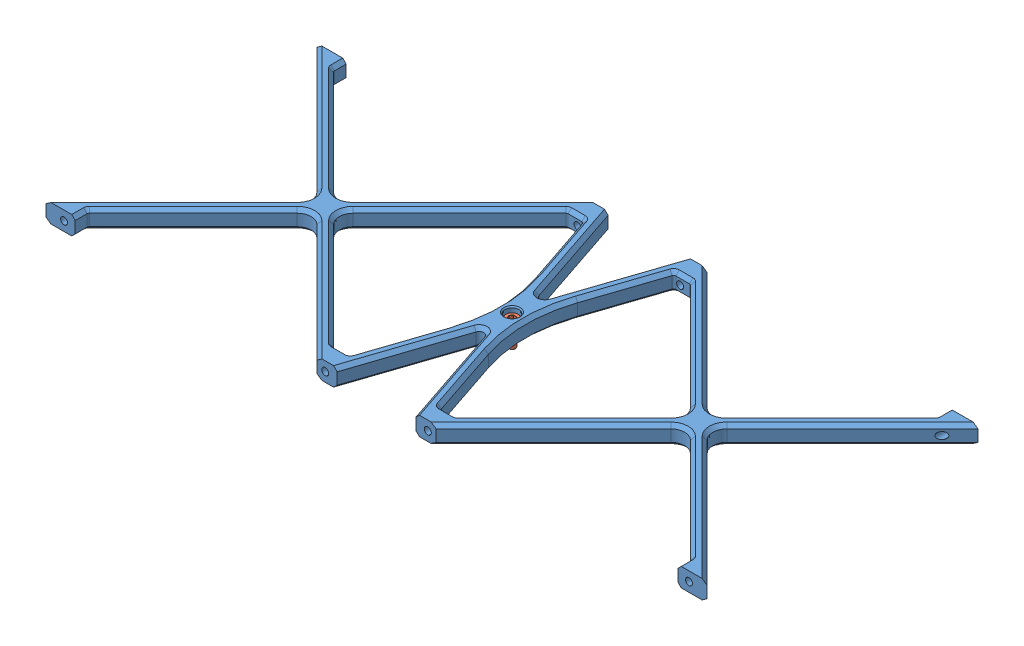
SolidWorks assembly body_structure_top.SLDASM, configuration Standard (file format 10000). Lengths in mm.
Overall size (324.78 13 116.2).
2 component instances, 2 part files, 2 mates.
Components (placement in the parent):
- body_structure_top-1: body_structure_top.SLDPRT [Standard] at origin size (324.78 8 116.2)
- fastener_shcs_m3_8-1: fastener_shcs_m3_8.SLDPRT [Standard] at (0 -1 0) x (-0.837169 0 -0.546944) z (0 1 0) size (5.5 5.5 11)
Mates (geometry in assembly coordinates):
- Konzentrisch1: concentric aligned: cylinder of body_structure_top-1 through (0 -4 0) axis (0 1 0) radius 1.5; cylinder of fastener_shcs_m3_8-1 through (0 20.9199 0) axis (0 1 0) radius 1.465
- Deckungsgleich1: coincident anti-aligned: plane of body_structure_top-1 through (0 -1 0) normal (0 1 0); plane of fastener_shcs_m3_8-1 through (-1.5041 -1 2.3022) normal (0 -1 0)
